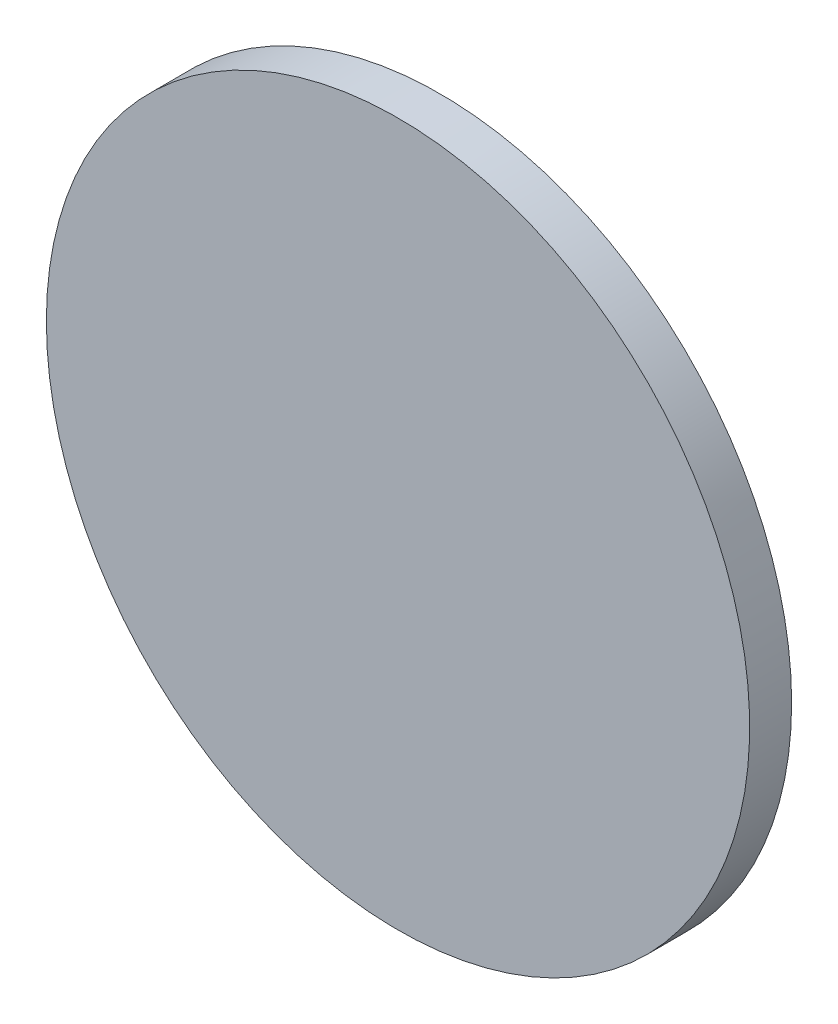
from build123d import *


with BuildPart() as part:
    # Sketch2 → Revolve1 (revolve)
    with BuildSketch(Plane(origin=(0, 0, 0), x_dir=(1, 0, 0), z_dir=(0, 1, 0)), mode=Mode.PRIVATE) as revolve1_sk:
        with BuildLine():
            Line((0, 0), (-25.4, 0))
            Line((-25.4, 0), (-25.4, 3))
            Line((-25.4, 3), (-25.4, 3.030323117))
            ThreePointArc((-25.4, 3.030323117), (-13.130542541, 8.004788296), (0, 9.7))
            Line((0, 9.7), (0, 0))
        make_face()
    revolve(revolve1_sk.sketch.rotate(Axis((0, 0, 0), (0, 0, 1)), 180), axis=Axis((0, 0, 0), (0, 0, 1)))


solid = part.part
